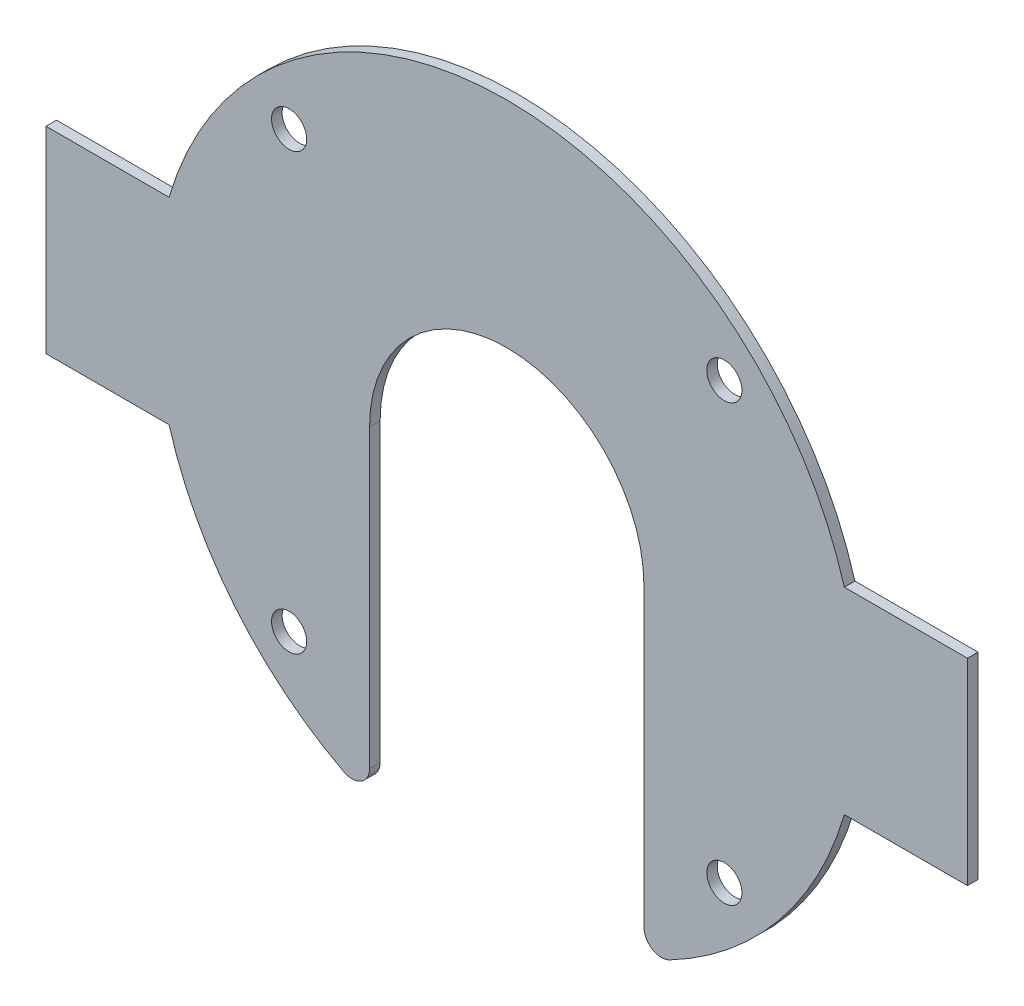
from build123d import *

# Parameters (mm, degrees)
ESQUISSE1_R        = 5
BOSS_EXTRU_1_DEPTH = 3


with BuildPart() as part:
    # Esquisse1 → Boss.-Extru.1 (new body)
    with BuildSketch(Plane.XY):
        with BuildLine():
            Line((96, 28), (131, 28))
            Line((131, 28), (131, -28))
            Line((131, -28), (96, -28))
            ThreePointArc((96, -28), (77.345793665, -63.384763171), (46.315789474, -88.627578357))
            ThreePointArc((46.315789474, -88.627578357), (41.409531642, -88.472818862), (39, -84.196199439))
            Line((39, -84.196199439), (39, 0))
            ThreePointArc((39, 0), (0, 39), (-39, 0))
            Line((-39, 0), (-39, -84.196199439))
            ThreePointArc((-39, -84.196199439), (-41.409531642, -88.472818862), (-46.315789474, -88.627578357))
            ThreePointArc((-46.315789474, -88.627578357), (-77.345793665, -63.384763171), (-96, -28))
            Line((-96, -28), (-131, -28))
            Line((-131, -28), (-131, 28))
            Line((-131, 28), (-96, 28))
            ThreePointArc((-96, 28), (0, 100), (96, 28))
        make_face()
        with Locations((61.871843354, 61.871843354)):
            Circle(ESQUISSE1_R, mode=Mode.SUBTRACT)
        with Locations((-61.871843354, 61.871843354)):
            Circle(ESQUISSE1_R, mode=Mode.SUBTRACT)
        with Locations((-61.871843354, -61.871843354)):
            Circle(ESQUISSE1_R, mode=Mode.SUBTRACT)
        with Locations((61.871843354, -61.871843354)):
            Circle(ESQUISSE1_R, mode=Mode.SUBTRACT)
    extrude(amount=BOSS_EXTRU_1_DEPTH)


solid = part.part
